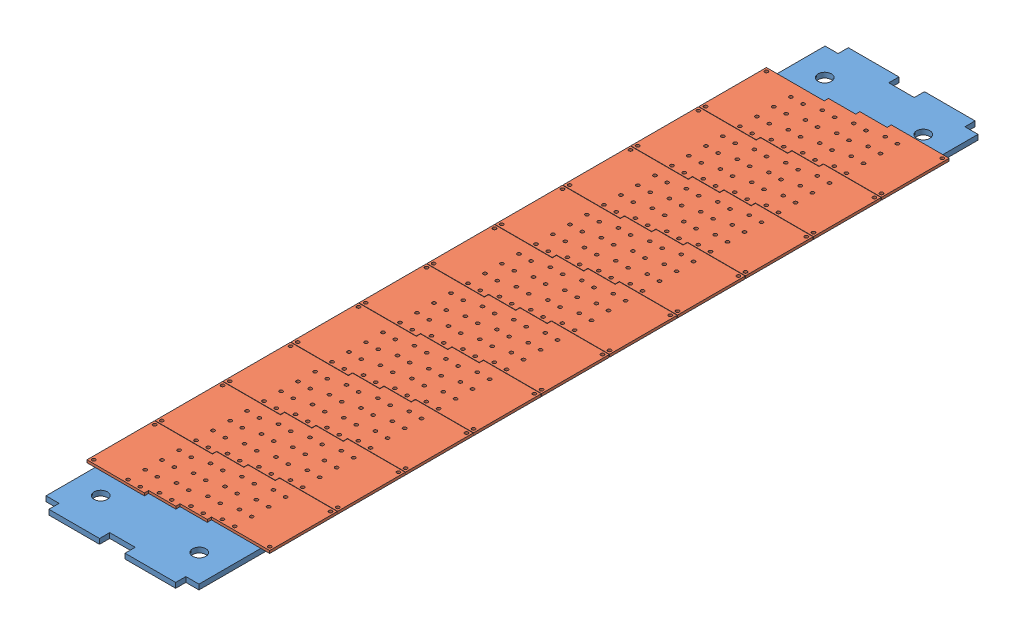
SolidWorks assembly Ensamblaje1.sldasm, configuration Predeterminado (file format 9000). Lengths in mm.
Overall size (100 4.5 470.4).
11 component instances, 2 part files, 30 mates.
Components (placement in the parent):
- Soporte Balines-2: Soporte Balines.SLDPRT [Predeterminado] at (-66.8687 -3.0826 699.6) size (90 3 470.4)
- circuito-1: circuito.SLDPRT [Predeterminado] at (-71.6687 -0.0826 310.7) x (0 0 -1) z (0 1 0) size (47.3 100 1.5)
- circuito-2: circuito.SLDPRT [Predeterminado] at (-71.6687 -0.0826 350.7) x (0 0 -1) z (0 1 0) size (47.3 100 1.5)
- circuito-3: circuito.SLDPRT [Predeterminado] at (-71.6687 -0.0826 390.7) x (0 0 -1) z (0 1 0) size (47.3 100 1.5)
- circuito-4: circuito.SLDPRT [Predeterminado] at (-71.6687 -0.0826 430.7) x (0 0 -1) z (0 1 0) size (47.3 100 1.5)
- circuito-5: circuito.SLDPRT [Predeterminado] at (-71.6687 -0.0826 470.7) x (0 0 -1) z (0 1 0) size (47.3 100 1.5)
- circuito-6: circuito.SLDPRT [Predeterminado] at (-71.6687 -0.0826 510.7) x (0 0 -1) z (0 1 0) size (47.3 100 1.5)
- circuito-7: circuito.SLDPRT [Predeterminado] at (-71.6687 -0.0826 550.7) x (0 0 -1) z (0 1 0) size (47.3 100 1.5)
- circuito-8: circuito.SLDPRT [Predeterminado] at (-71.6687 -0.0826 590.7) x (0 0 -1) z (0 1 0) size (47.3 100 1.5)
- circuito-9: circuito.SLDPRT [Predeterminado] at (-71.6687 -0.0826 630.7) x (0 0 -1) z (0 1 0) size (47.3 100 1.5)
- circuito-10: circuito.SLDPRT [Predeterminado] at (-71.6687 -0.0826 670.7) x (0 0 -1) z (0 1 0) size (47.3 100 1.5)
Mates (geometry in assembly coordinates):
- Concéntrica1: concentric aligned: circle of Soporte Balines-2; circle of circuito-1
- Concéntrica2: concentric aligned: circle of Soporte Balines-2; circle of circuito-1
- Concéntrica3: concentric aligned: circle of Soporte Balines-2; circle of circuito-2
- Concéntrica4: concentric aligned: circle of Soporte Balines-2; circle of circuito-2
- Coincidente1: coincident anti-aligned: plane of Soporte Balines-2 through (-66.8687 -0.0826 699.6) normal (0 1 0); plane of circuito-1 through (-71.6687 -0.0826 310.7) normal (0 -1 0)
- Coincidente2: coincident anti-aligned: plane of Soporte Balines-2 through (-66.8687 -0.0826 699.6) normal (0 1 0); plane of circuito-2 through (-71.6687 -0.0826 350.7) normal (0 -1 0)
- Concéntrica5: concentric aligned: circle of Soporte Balines-2; circle of circuito-3
- Concéntrica6: concentric aligned: circle of Soporte Balines-2; circle of circuito-3
- Concéntrica7: concentric aligned: circle of Soporte Balines-2; circle of circuito-4
- Concéntrica8: concentric aligned: circle of Soporte Balines-2; circle of circuito-4
- Coincidente3: coincident anti-aligned: plane of Soporte Balines-2 through (-66.8687 -0.0826 699.6) normal (0 1 0); plane of circuito-3 through (-71.6687 -0.0826 390.7) normal (0 -1 0)
- Coincidente4: coincident anti-aligned: plane of Soporte Balines-2 through (-66.8687 -0.0826 699.6) normal (0 1 0); plane of circuito-4 through (-71.6687 -0.0826 430.7) normal (0 -1 0)
- Concéntrica9: concentric aligned: circle of Soporte Balines-2; circle of circuito-5
- Concéntrica10: concentric aligned: circle of Soporte Balines-2; circle of circuito-5
- Concéntrica11: concentric aligned: circle of Soporte Balines-2; circle of circuito-6
- Concéntrica12: concentric aligned: circle of Soporte Balines-2; circle of circuito-6
- Concéntrica13: concentric aligned: circle of Soporte Balines-2; circle of circuito-7
- Concéntrica14: concentric aligned: circle of Soporte Balines-2; circle of circuito-7
- Concéntrica15: concentric aligned: circle of Soporte Balines-2; circle of circuito-8
- Concéntrica16: concentric aligned: circle of Soporte Balines-2; circle of circuito-8
- Concéntrica17: concentric aligned: circle of Soporte Balines-2; circle of circuito-9
- Concéntrica18: concentric aligned: circle of Soporte Balines-2; circle of circuito-9
- Concéntrica19: concentric aligned: circle of Soporte Balines-2; circle of circuito-10
- Concéntrica20: concentric aligned: circle of Soporte Balines-2; circle of circuito-10
- Coincidente5: coincident anti-aligned: plane of Soporte Balines-2 through (-66.8687 -0.0826 699.6) normal (0 1 0); plane of circuito-5 through (-71.6687 -0.0826 470.7) normal (0 -1 0)
- Coincidente6: coincident anti-aligned: plane of Soporte Balines-2 through (-66.8687 -0.0826 699.6) normal (0 1 0); plane of circuito-6 through (-71.6687 -0.0826 510.7) normal (0 -1 0)
- Coincidente7: coincident anti-aligned: plane of Soporte Balines-2 through (-66.8687 -0.0826 699.6) normal (0 1 0); plane of circuito-7 through (-71.6687 -0.0826 550.7) normal (0 -1 0)
- Coincidente8: coincident anti-aligned: plane of Soporte Balines-2 through (-66.8687 -0.0826 699.6) normal (0 1 0); plane of circuito-8 through (-71.6687 -0.0826 590.7) normal (0 -1 0)
- Coincidente9: coincident anti-aligned: plane of Soporte Balines-2 through (-66.8687 -0.0826 699.6) normal (0 1 0); plane of circuito-9 through (-71.6687 -0.0826 630.7) normal (0 -1 0)
- Coincidente10: coincident anti-aligned: plane of Soporte Balines-2 through (-66.8687 -0.0826 699.6) normal (0 1 0); plane of circuito-10 through (-71.6687 -0.0826 670.7) normal (0 -1 0)
